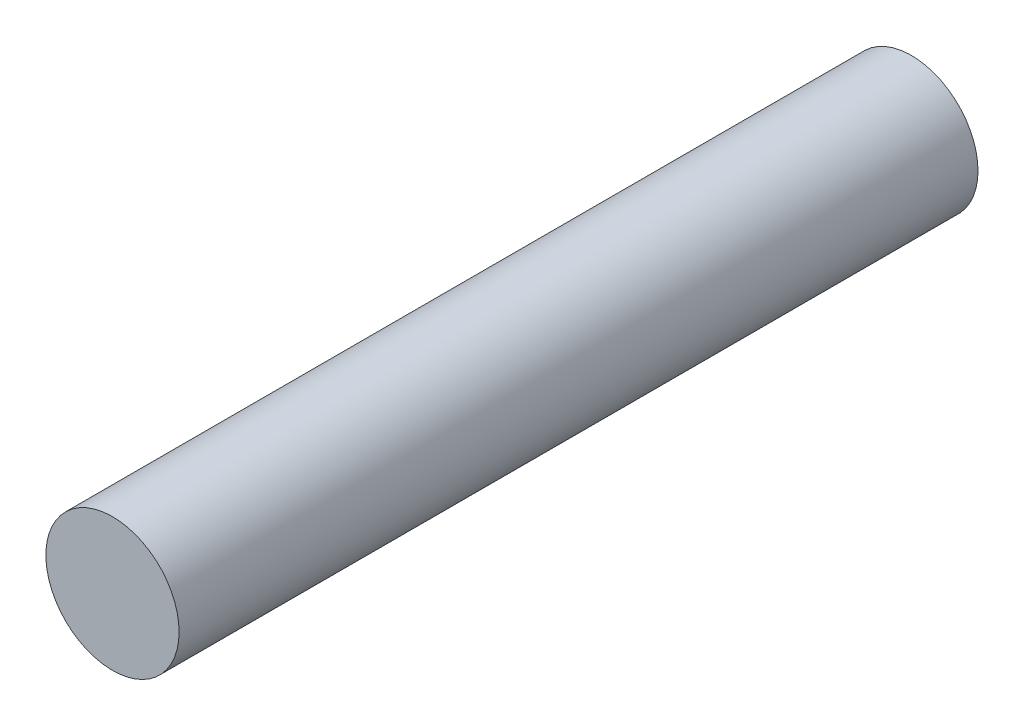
from build123d import *

# Parameters (mm, degrees)
ESQUISSE1_R          = 1.25
BASE_EXTRUSION_DEPTH = 14.99


with BuildPart() as part:
    # Esquisse1 → Base-Extrusion (new body)
    with BuildSketch(Plane.XY):
        Circle(ESQUISSE1_R)
    extrude(amount=BASE_EXTRUSION_DEPTH)


solid = part.part
